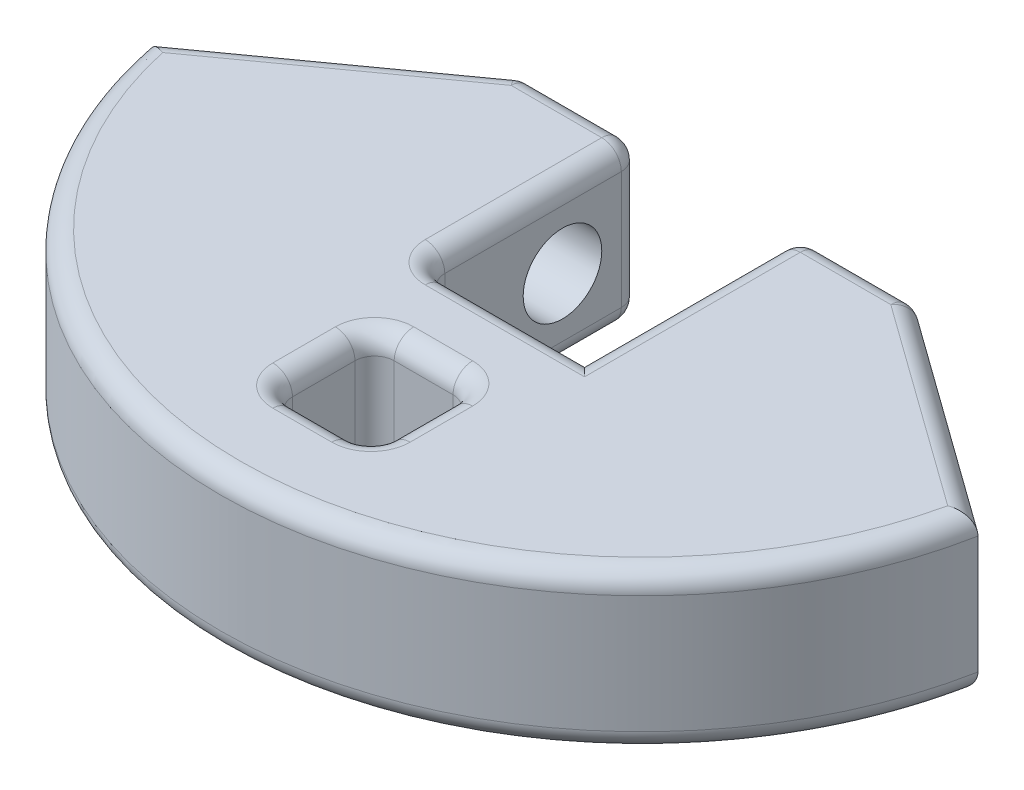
from build123d import *

# Parameters (mm, degrees)
BOSS_EXTRUDE1_DEPTH     = 6.35
CUT_EXTRUDE1_DEPTH      = 49.684771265
CUT_EXTRUDE1_DEPTH_BACK = 49.684771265
CUT_EXTRUDE2_DEPTH      = 49.268876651
CUT_EXTRUDE2_DEPTH_BACK = 49.268876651
SKETCH3_R               = 3.18135
FILLET1_R               = 1.5875
SKETCH5_W               = 8.232446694
SKETCH5_H               = 12.7
CUT_EXTRUDE3_DEPTH      = 3.96875
FILLET2_R               = 1.5875


with BuildPart() as part:
    # Sketch1 → Boss-Extrude1 (new, symmetric)
    with BuildSketch(Plane(origin=(0, 0, 0), x_dir=(1, 0, 0), z_dir=(0, 1, 0))):
        with BuildLine():
            Line((-33.535350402, 6.35), (-6.44921875, 6.35))
            Line((-6.44921875, 6.35), (-6.44921875, -11.1125))
            Line((-6.44921875, -11.1125), (6.44921875, -11.1125))
            Line((6.44921875, -11.1125), (6.44921875, 6.35))
            Line((6.44921875, 6.35), (33.535350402, 6.35))
            ThreePointArc((33.535350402, 6.35), (0, -34.13125), (-33.535350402, 6.35))
        make_face()
    extrude(amount=BOSS_EXTRUDE1_DEPTH, both=True)

    # Sketch2 → Cut-Extrude1 (cut, two sides: drawn at the far end of the back side and taken through both)
    with BuildSketch(Plane(origin=(0, 0, 0), x_dir=(1, 0, 0), z_dir=(0, 1, 0)).offset(-CUT_EXTRUDE1_DEPTH_BACK)):
        Polygon((-39.338837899, -6.35), (-33.535350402, -6.35), (-15.875, 6.35), (-15.875, 13.899802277), (15.875, 13.899802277), (15.875, 6.35), (33.535350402, -6.35), (44.247938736, -6.35), (44.247938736, 26.233137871), (-39.338837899, 26.233137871), align=None)
    extrude(amount=CUT_EXTRUDE1_DEPTH + CUT_EXTRUDE1_DEPTH_BACK, mode=Mode.SUBTRACT)

    # Sketch3 → Cut-Extrude2 (cut, two sides: drawn at the far end of the back side and taken through both)
    with BuildSketch(Plane(origin=(0, 0, 0), x_dir=(0, 0, -1), z_dir=(1, 0, 0)).offset(-CUT_EXTRUDE2_DEPTH_BACK)):
        Circle(SKETCH3_R)
    extrude(amount=CUT_EXTRUDE2_DEPTH + CUT_EXTRUDE2_DEPTH_BACK, mode=Mode.SUBTRACT)

    # Fillet1
    fillet1_edges = [part.edges().sort_by_distance(p)[0] for p in [
        (-6.44921875, 0, -6.35),
        (-6.44921875, 0, 11.1125),
        (6.44921875, 0, -6.35),
        (6.44921875, 6.35, 2.38125),
        (0, 6.35, 11.1125),
        (0, -6.35, 34.13125),
        (11.162109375, -6.35, -6.35),
        (-6.44921875, 6.35, 2.38125),
        (0, 6.35, 34.13125),
        (11.162109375, 6.35, -6.35),
        (-11.162109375, 6.35, -6.35),
        (24.705175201, 6.35, 0),
        (-24.705175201, 6.35, 0),
        (24.705175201, -6.35, 0),
        (15.875, 0, -6.35),
        (-15.875, 0, -6.35),
        (-24.705175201, -6.35, 0),
        (-11.162109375, -6.35, -6.35),
        (-6.44921875, -6.35, 2.38125),
        (0, -6.35, 11.1125),
        (6.44921875, -6.35, 2.38125),
    ]]
    fillet(fillet1_edges, radius=FILLET1_R)

    # Sketch5 → Cut-Extrude3 (cut, symmetric)
    with BuildSketch(Plane(origin=(0, 0, 0), x_dir=(0, 0, -1), z_dir=(1, 0, 0))):
        with Locations((-21.807099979, 0)):
            Rectangle(SKETCH5_W, SKETCH5_H)
    extrude(amount=CUT_EXTRUDE3_DEPTH, both=True, mode=Mode.SUBTRACT)

    # Fillet2
    fillet2_edges = [part.edges().sort_by_distance(p)[0] for p in [
        (-3.96875, 0, 25.923323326),
        (0, -6.35, 25.923323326),
        (-3.96875, 6.35, 21.807099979),
        (0, 6.35, 25.923323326),
        (-3.96875, 0, 17.690876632),
        (0, 6.35, 17.690876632),
        (-3.96875, -6.35, 21.807099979),
        (0, -6.35, 17.690876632),
        (3.96875, 0, 25.923323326),
        (3.96875, -6.35, 21.807099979),
        (3.96875, 0, 17.690876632),
        (3.96875, 6.35, 21.807099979),
    ]]
    fillet(fillet2_edges, radius=FILLET2_R)


solid = part.part
